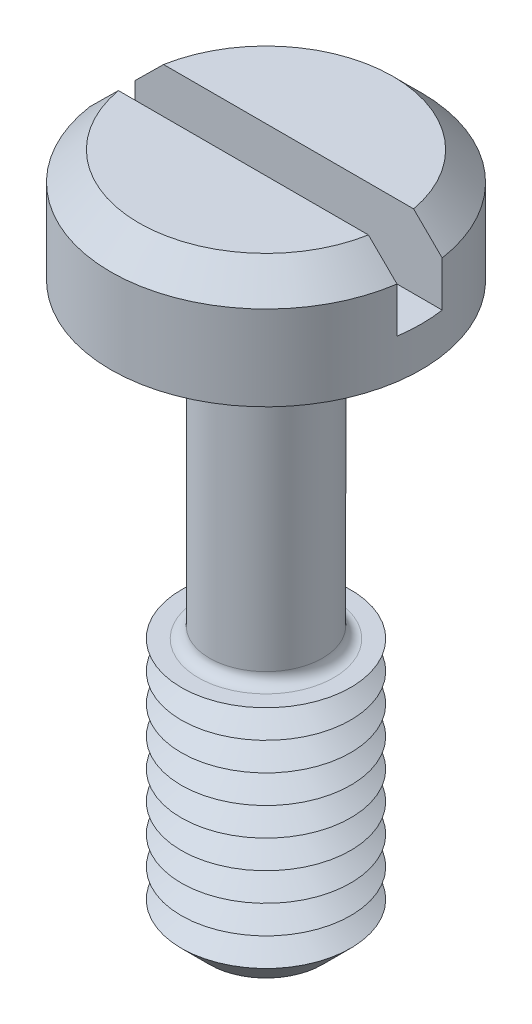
ISO-10303-21;
HEADER;
FILE_DESCRIPTION(('STEP AP214'),'2;1');
FILE_NAME('part.step','',(''),(''),'','','');
FILE_SCHEMA(('AUTOMOTIVE_DESIGN { 1 0 10303 214 1 1 1 1 }'));
ENDSEC;
DATA;
#1=APPLICATION_CONTEXT('core data for automotive mechanical design processes');
#2=APPLICATION_PROTOCOL_DEFINITION('international standard','automotive_design',2000,#1);
#3=PRODUCT_CONTEXT('',#1,'mechanical');
#4=PRODUCT('Part','Part','',(#3));
#5=PRODUCT_RELATED_PRODUCT_CATEGORY('part','',(#4));
#6=PRODUCT_DEFINITION_FORMATION('','',#4);
#7=PRODUCT_DEFINITION_CONTEXT('part definition',#1,'design');
#8=PRODUCT_DEFINITION('design','',#6,#7);
#9=PRODUCT_DEFINITION_SHAPE('','',#8);
#10=(LENGTH_UNIT() NAMED_UNIT(*) SI_UNIT(.MILLI.,.METRE.));
#11=(NAMED_UNIT(*) PLANE_ANGLE_UNIT() SI_UNIT($,.RADIAN.));
#12=(NAMED_UNIT(*) SI_UNIT($,.STERADIAN.) SOLID_ANGLE_UNIT());
#13=UNCERTAINTY_MEASURE_WITH_UNIT(LENGTH_MEASURE(1.E-05),#10,'distance_accuracy_value','');
#14=(GEOMETRIC_REPRESENTATION_CONTEXT(3) GLOBAL_UNCERTAINTY_ASSIGNED_CONTEXT((#13)) GLOBAL_UNIT_ASSIGNED_CONTEXT((#10,
#11,#12)) REPRESENTATION_CONTEXT('',''));
#15=CARTESIAN_POINT('',(0.,0.,0.));
#16=DIRECTION('',(0.,0.,1.));
#17=DIRECTION('',(1.,0.,0.));
#18=AXIS2_PLACEMENT_3D('',#15,#16,#17);
#19=CARTESIAN_POINT('',(0.,2.,0.));
#20=DIRECTION('',(0.,1.,0.));
#21=DIRECTION('',(0.,0.,1.));
#22=AXIS2_PLACEMENT_3D('',#19,#20,#21);
#23=PLANE('',#22);
#24=DIRECTION('',(-1.,0.,0.));
#25=VECTOR('',#24,1.);
#26=CARTESIAN_POINT('',(2.75,2.,-0.4));
#27=LINE('',#26,#25);
#28=CARTESIAN_POINT('',(2.21415898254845,2.,-0.4));
#29=VERTEX_POINT('',#28);
#30=CARTESIAN_POINT('',(-2.21415898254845,2.,-0.4));
#31=VERTEX_POINT('',#30);
#32=EDGE_CURVE('E110',#29,#31,#27,.T.);
#33=ORIENTED_EDGE('',*,*,#32,.F.);
#34=CARTESIAN_POINT('',(0.,2.,0.));
#35=DIRECTION('',(0.,1.,0.));
#36=DIRECTION('',(0.,0.,1.));
#37=AXIS2_PLACEMENT_3D('',#34,#35,#36);
#38=CIRCLE('',#37,2.25);
#39=EDGE_CURVE('E113',#29,#31,#38,.T.);
#40=ORIENTED_EDGE('',*,*,#39,.T.);
#41=EDGE_LOOP('',(#33,#40));
#42=FACE_BOUND('',#41,.T.);
#43=ADVANCED_FACE('F39',(#42),#23,.T.);
#44=CARTESIAN_POINT('',(0.,2.,0.));
#45=DIRECTION('',(0.,-1.,0.));
#46=DIRECTION('',(0.,0.,-1.));
#47=AXIS2_PLACEMENT_3D('',#44,#45,#46);
#48=CONICAL_SURFACE('',#47,2.25,0.785398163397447);
#49=CARTESIAN_POINT('',(6.05060089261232,-1.81380830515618,-0.4));
#50=CARTESIAN_POINT('',(5.84217393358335,-1.60583904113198,-0.4));
#51=CARTESIAN_POINT('',(5.63372707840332,-1.3978896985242,-0.4));
#52=CARTESIAN_POINT('',(5.21676338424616,-0.982052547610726,-0.4));
#53=CARTESIAN_POINT('',(5.0082465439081,-0.774164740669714,-0.4));
#54=CARTESIAN_POINT('',(4.59102343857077,-0.35838342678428,-0.4));
#55=CARTESIAN_POINT('',(4.38231713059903,-0.150489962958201,-0.4));
#56=CARTESIAN_POINT('',(3.96477014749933,0.265153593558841,-0.4));
#57=CARTESIAN_POINT('',(3.75592947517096,0.472903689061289,-0.4));
#58=CARTESIAN_POINT('',(3.33589913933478,0.890287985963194,-0.4));
#59=CARTESIAN_POINT('',(3.12470717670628,1.09991987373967,-0.4));
#60=CARTESIAN_POINT('',(2.7019134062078,1.51879562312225,-0.4));
#61=CARTESIAN_POINT('',(2.49031157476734,1.72803946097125,-0.4));
#62=CARTESIAN_POINT('',(2.17231429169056,2.04123939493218,-0.4));
#63=CARTESIAN_POINT('',(2.06623184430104,2.14551302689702,-0.4));
#64=CARTESIAN_POINT('',(1.85373145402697,2.35372301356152,-0.4));
#65=CARTESIAN_POINT('',(1.74731350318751,2.45765936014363,-0.4));
#66=CARTESIAN_POINT('',(1.53394692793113,2.6649644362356,-0.4));
#67=CARTESIAN_POINT('',(1.42699836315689,2.76833322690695,-0.4));
#68=CARTESIAN_POINT('',(1.26580938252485,2.92258234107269,-0.4));
#69=CARTESIAN_POINT('',(1.21195308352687,2.97386371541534,-0.4));
#70=CARTESIAN_POINT('',(1.10386632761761,3.07603025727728,-0.4));
#71=CARTESIAN_POINT('',(1.0496358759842,3.12691543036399,-0.4));
#72=CARTESIAN_POINT('',(0.965529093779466,3.20495157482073,-0.4));
#73=CARTESIAN_POINT('',(0.935852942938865,3.23231811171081,-0.4));
#74=CARTESIAN_POINT('',(0.876282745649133,3.28681446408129,-0.4));
#75=CARTESIAN_POINT('',(0.846388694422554,3.31394427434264,-0.4));
#76=CARTESIAN_POINT('',(0.786319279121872,3.3678876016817,-0.4));
#77=CARTESIAN_POINT('',(0.75614393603,3.39470114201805,-0.4));
#78=CARTESIAN_POINT('',(0.695411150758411,3.44788757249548,-0.4));
#79=CARTESIAN_POINT('',(0.664853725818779,3.4742604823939,-0.4));
#80=CARTESIAN_POINT('',(0.587773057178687,3.53947080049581,-0.4));
#81=CARTESIAN_POINT('',(0.540923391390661,3.57793090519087,-0.4));
#82=CARTESIAN_POINT('',(0.4691083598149,3.63368803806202,-0.4));
#83=CARTESIAN_POINT('',(0.444902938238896,3.65195872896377,-0.4));
#84=CARTESIAN_POINT('',(0.39579650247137,3.68753467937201,-0.4));
#85=CARTESIAN_POINT('',(0.370895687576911,3.70484021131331,-0.4));
#86=CARTESIAN_POINT('',(0.315135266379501,3.74129905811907,-0.4));
#87=CARTESIAN_POINT('',(0.284069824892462,3.76014262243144,-0.4));
#88=CARTESIAN_POINT('',(0.220007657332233,3.79429188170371,-0.4));
#89=CARTESIAN_POINT('',(0.187014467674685,3.80960381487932,-0.4));
#90=CARTESIAN_POINT('',(0.129469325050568,3.83013103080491,-0.4));
#91=CARTESIAN_POINT('',(0.105533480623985,3.83700748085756,-0.4));
#92=CARTESIAN_POINT('',(0.0568861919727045,3.8466714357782,-0.4));
#93=CARTESIAN_POINT('',(0.0321777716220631,3.84947323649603,-0.4));
#94=CARTESIAN_POINT('',(-0.0174556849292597,3.8503913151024,-0.4));
#95=CARTESIAN_POINT('',(-0.0423811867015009,3.84848412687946,-0.4));
#96=CARTESIAN_POINT('',(-0.0915464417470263,3.84038297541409,-0.4));
#97=CARTESIAN_POINT('',(-0.115784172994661,3.83417751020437,-0.4));
#98=CARTESIAN_POINT('',(-0.164015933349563,3.81830420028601,-0.4));
#99=CARTESIAN_POINT('',(-0.187969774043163,3.80851974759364,-0.4));
#100=CARTESIAN_POINT('',(-0.234812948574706,3.78663483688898,-0.4));
#101=CARTESIAN_POINT('',(-0.25770025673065,3.77453017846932,-0.4));
#102=CARTESIAN_POINT('',(-0.302761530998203,3.74868049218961,-0.4));
#103=CARTESIAN_POINT('',(-0.324928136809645,3.73492286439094,-0.4));
#104=CARTESIAN_POINT('',(-0.368536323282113,3.70635481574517,-0.4));
#105=CARTESIAN_POINT('',(-0.389978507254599,3.69154530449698,-0.4));
#106=CARTESIAN_POINT('',(-0.457169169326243,3.64340388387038,-0.4));
#107=CARTESIAN_POINT('',(-0.501937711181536,3.60871473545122,-0.4));
#108=CARTESIAN_POINT('',(-0.590074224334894,3.53759028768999,-0.4));
#109=CARTESIAN_POINT('',(-0.633441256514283,3.50115385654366,-0.4));
#110=CARTESIAN_POINT('',(-0.719371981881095,3.42718980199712,-0.4));
#111=CARTESIAN_POINT('',(-0.761934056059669,3.38966030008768,-0.4));
#112=CARTESIAN_POINT('',(-0.846465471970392,3.31396862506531,-0.4));
#113=CARTESIAN_POINT('',(-0.888434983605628,3.27580664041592,-0.4));
#114=CARTESIAN_POINT('',(-1.01351008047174,3.16091722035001,-0.4));
#115=CARTESIAN_POINT('',(-1.09603733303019,3.08356131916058,-0.4));
#116=CARTESIAN_POINT('',(-1.26020205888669,2.92809304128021,-0.4));
#117=CARTESIAN_POINT('',(-1.34184039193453,2.84998156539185,-0.4));
#118=CARTESIAN_POINT('',(-1.50425180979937,2.69362860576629,-0.4));
#119=CARTESIAN_POINT('',(-1.58502715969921,2.61538947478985,-0.4));
#120=CARTESIAN_POINT('',(-1.74627332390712,2.4585978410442,-0.4));
#121=CARTESIAN_POINT('',(-1.82674413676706,2.38004533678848,-0.4));
#122=CARTESIAN_POINT('',(-2.06785619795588,2.14407469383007,-0.4));
#123=CARTESIAN_POINT('',(-2.22819388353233,1.98634651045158,-0.4));
#124=CARTESIAN_POINT('',(-2.54852691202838,1.67040441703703,-0.4));
#125=CARTESIAN_POINT('',(-2.70852207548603,1.51219032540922,-0.4));
#126=CARTESIAN_POINT('',(-3.02826273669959,1.19551306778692,-0.4));
#127=CARTESIAN_POINT('',(-3.18800823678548,1.03704990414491,-0.4));
#128=CARTESIAN_POINT('',(-3.66699080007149,0.561455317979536,-0.4));
#129=CARTESIAN_POINT('',(-3.98599924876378,0.244093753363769,-0.4));
#130=CARTESIAN_POINT('',(-4.6236988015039,-0.390879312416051,-0.4));
#131=CARTESIAN_POINT('',(-4.94238993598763,-0.708490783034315,-0.4));
#132=CARTESIAN_POINT('',(-5.39262624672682,-1.15743192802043,-0.4));
#133=CARTESIAN_POINT('',(-5.52423897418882,-1.28869385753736,-0.4));
#134=CARTESIAN_POINT('',(-5.78743776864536,-1.55123695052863,-0.4));
#135=CARTESIAN_POINT('',(-5.91902383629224,-1.68251811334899,-0.4));
#136=CARTESIAN_POINT('',(-6.05060089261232,-1.81380830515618,-0.4));
#137=B_SPLINE_CURVE_WITH_KNOTS('',3,(#49,#50,#51,#52,#53,#54,#55,#56,#57,#58,#59,#60,#61,#62,
#63,#64,#65,#66,#67,#68,#69,#70,#71,#72,#73,#74,#75,#76,#77,#78,#79,#80,#81,#82,#83,#84,#85,#86,
#87,#88,#89,#90,#91,#92,#93,#94,#95,#96,#97,#98,#99,#100,#101,#102,#103,#104,#105,#106,#107,
#108,#109,#110,#111,#112,#113,#114,#115,#116,#117,#118,#119,#120,#121,#122,#123,#124,#125,#126,
#127,#128,#129,#130,#131,#132,#133,#134,#135,#136),.UNSPECIFIED.,.F.,.F.,(4,2,2,2,2,2,2,2,2,2,2,
2,2,2,2,2,2,2,2,2,2,2,2,2,2,2,2,2,2,2,2,2,2,2,2,2,2,2,2,2,2,2,2,4),(0.,0.883310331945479,
1.76663897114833,2.65038219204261,3.53410755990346,4.42681573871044,5.31957687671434,
5.76582544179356,6.21208466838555,6.65829482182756,6.88139126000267,7.10448455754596,
7.22558850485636,7.34669511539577,7.46779276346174,7.58888496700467,7.77066509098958,
7.86163037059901,7.95256984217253,8.06146372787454,8.17016376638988,8.24461141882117,
8.31879723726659,8.39335348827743,8.46811002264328,8.54555790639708,8.62314734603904,
8.70137101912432,8.77952785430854,8.94932745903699,9.11923857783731,9.28946128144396,
9.45963414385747,9.79895964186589,10.1379210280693,10.475282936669,10.8126464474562,
11.4873867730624,12.1624208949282,12.8374486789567,14.1873973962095,15.5372009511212,
16.0948428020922,16.6524687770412),.UNSPECIFIED.);
#138=CARTESIAN_POINT('',(2.72075357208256,1.5,-0.4));
#139=VERTEX_POINT('',#138);
#140=EDGE_CURVE('E259',#139,#29,#137,.T.);
#141=ORIENTED_EDGE('',*,*,#140,.F.);
#142=CARTESIAN_POINT('',(0.,1.5,0.));
#143=DIRECTION('',(0.,1.,0.));
#144=DIRECTION('',(0.,0.,1.));
#145=AXIS2_PLACEMENT_3D('',#142,#143,#144);
#146=CIRCLE('',#145,2.75);
#147=CARTESIAN_POINT('',(-2.72075357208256,1.5,-0.4));
#148=VERTEX_POINT('',#147);
#149=EDGE_CURVE('E127',#148,#139,#146,.F.);
#150=ORIENTED_EDGE('',*,*,#149,.F.);
#151=EDGE_CURVE('E102',#31,#148,#137,.T.);
#152=ORIENTED_EDGE('',*,*,#151,.F.);
#153=ORIENTED_EDGE('',*,*,#39,.F.);
#154=EDGE_LOOP('',(#141,#150,#152,#153));
#155=FACE_BOUND('',#154,.T.);
#156=ADVANCED_FACE('F221',(#155),#48,.T.);
#157=CARTESIAN_POINT('',(0.,-10.,0.));
#158=DIRECTION('',(0.,1.,0.));
#159=DIRECTION('',(0.,0.,1.));
#160=AXIS2_PLACEMENT_3D('',#157,#158,#159);
#161=CYLINDRICAL_SURFACE('',#160,1.);
#162=CARTESIAN_POINT('',(0.,-5.3,0.));
#163=DIRECTION('',(0.,-1.,0.));
#164=DIRECTION('',(0.,0.,-1.));
#165=AXIS2_PLACEMENT_3D('',#162,#163,#164);
#166=CIRCLE('',#165,1.);
#167=CARTESIAN_POINT('',(0.,-5.3,-1.));
#168=VERTEX_POINT('',#167);
#169=EDGE_CURVE('E122',#168,#168,#166,.F.);
#170=ORIENTED_EDGE('',*,*,#169,.T.);
#171=EDGE_LOOP('',(#170));
#172=FACE_BOUND('',#171,.T.);
#173=CARTESIAN_POINT('',(0.,-0.200000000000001,0.));
#174=DIRECTION('',(0.,1.,0.));
#175=DIRECTION('',(0.,0.,1.));
#176=AXIS2_PLACEMENT_3D('',#173,#174,#175);
#177=CIRCLE('',#176,1.);
#178=CARTESIAN_POINT('',(0.,-0.200000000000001,1.));
#179=VERTEX_POINT('',#178);
#180=EDGE_CURVE('E365',#179,#179,#177,.F.);
#181=ORIENTED_EDGE('',*,*,#180,.T.);
#182=EDGE_LOOP('',(#181));
#183=FACE_BOUND('',#182,.T.);
#184=ADVANCED_FACE('F217',(#172,#183),#161,.T.);
#185=CARTESIAN_POINT('',(0.,2.,0.));
#186=DIRECTION('',(0.,-1.,0.));
#187=DIRECTION('',(0.,0.,-1.));
#188=AXIS2_PLACEMENT_3D('',#185,#186,#187);
#189=CYLINDRICAL_SURFACE('',#188,2.75);
#190=ORIENTED_EDGE('',*,*,#149,.T.);
#191=DIRECTION('',(0.,-1.,0.));
#192=VECTOR('',#191,1.);
#193=CARTESIAN_POINT('',(2.72075357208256,2.,-0.4));
#194=LINE('',#193,#192);
#195=CARTESIAN_POINT('',(2.72075357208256,0.7,-0.4));
#196=VERTEX_POINT('',#195);
#197=EDGE_CURVE('E64',#139,#196,#194,.T.);
#198=ORIENTED_EDGE('',*,*,#197,.T.);
#199=CARTESIAN_POINT('',(0.,0.7,0.));
#200=DIRECTION('',(0.,1.,0.));
#201=DIRECTION('',(0.,0.,1.));
#202=AXIS2_PLACEMENT_3D('',#199,#200,#201);
#203=CIRCLE('',#202,2.75);
#204=CARTESIAN_POINT('',(2.72075357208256,0.7,0.4));
#205=VERTEX_POINT('',#204);
#206=EDGE_CURVE('E11',#205,#196,#203,.T.);
#207=ORIENTED_EDGE('',*,*,#206,.F.);
#208=DIRECTION('',(0.,-1.,0.));
#209=VECTOR('',#208,1.);
#210=CARTESIAN_POINT('',(2.72075357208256,2.,0.4));
#211=LINE('',#210,#209);
#212=CARTESIAN_POINT('',(2.72075357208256,1.5,0.4));
#213=VERTEX_POINT('',#212);
#214=EDGE_CURVE('E275',#205,#213,#211,.F.);
#215=ORIENTED_EDGE('',*,*,#214,.T.);
#216=CARTESIAN_POINT('',(-2.72075357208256,1.5,0.4));
#217=VERTEX_POINT('',#216);
#218=EDGE_CURVE('E120',#213,#217,#146,.F.);
#219=ORIENTED_EDGE('',*,*,#218,.T.);
#220=DIRECTION('',(0.,-1.,0.));
#221=VECTOR('',#220,1.);
#222=CARTESIAN_POINT('',(-2.72075357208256,2.,0.4));
#223=LINE('',#222,#221);
#224=CARTESIAN_POINT('',(-2.72075357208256,0.7,0.4));
#225=VERTEX_POINT('',#224);
#226=EDGE_CURVE('E96',#217,#225,#223,.T.);
#227=ORIENTED_EDGE('',*,*,#226,.T.);
#228=CARTESIAN_POINT('',(-2.72075357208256,0.7,-0.4));
#229=VERTEX_POINT('',#228);
#230=EDGE_CURVE('E44',#229,#225,#203,.T.);
#231=ORIENTED_EDGE('',*,*,#230,.F.);
#232=DIRECTION('',(0.,-1.,0.));
#233=VECTOR('',#232,1.);
#234=CARTESIAN_POINT('',(-2.72075357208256,2.,-0.4));
#235=LINE('',#234,#233);
#236=EDGE_CURVE('E280',#229,#148,#235,.F.);
#237=ORIENTED_EDGE('',*,*,#236,.T.);
#238=EDGE_LOOP('',(#190,#198,#207,#215,#219,#227,#231,#237));
#239=FACE_BOUND('',#238,.T.);
#240=CARTESIAN_POINT('',(0.,0.,0.));
#241=DIRECTION('',(0.,1.,0.));
#242=DIRECTION('',(0.,0.,1.));
#243=AXIS2_PLACEMENT_3D('',#240,#241,#242);
#244=CIRCLE('',#243,2.75);
#245=CARTESIAN_POINT('',(0.,0.,2.75));
#246=VERTEX_POINT('',#245);
#247=EDGE_CURVE('E354',#246,#246,#244,.T.);
#248=ORIENTED_EDGE('',*,*,#247,.T.);
#249=EDGE_LOOP('',(#248));
#250=FACE_BOUND('',#249,.T.);
#251=ADVANCED_FACE('F220',(#239,#250),#189,.T.);
#252=DIRECTION('',(1.,0.,0.));
#253=VECTOR('',#252,1.);
#254=CARTESIAN_POINT('',(2.75,2.,0.4));
#255=LINE('',#254,#253);
#256=CARTESIAN_POINT('',(-2.21415898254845,2.,0.4));
#257=VERTEX_POINT('',#256);
#258=CARTESIAN_POINT('',(2.21415898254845,2.,0.4));
#259=VERTEX_POINT('',#258);
#260=EDGE_CURVE('E56',#257,#259,#255,.T.);
#261=ORIENTED_EDGE('',*,*,#260,.F.);
#262=EDGE_CURVE('E108',#257,#259,#38,.T.);
#263=ORIENTED_EDGE('',*,*,#262,.T.);
#264=EDGE_LOOP('',(#261,#263));
#265=FACE_BOUND('',#264,.T.);
#266=ADVANCED_FACE('F107',(#265),#23,.T.);
#267=CARTESIAN_POINT('',(0.,0.,0.));
#268=DIRECTION('',(0.,1.,0.));
#269=DIRECTION('',(0.,0.,1.));
#270=AXIS2_PLACEMENT_3D('',#267,#268,#269);
#271=PLANE('',#270);
#272=CARTESIAN_POINT('',(0.,0.,0.));
#273=DIRECTION('',(0.,1.,0.));
#274=DIRECTION('',(0.,0.,1.));
#275=AXIS2_PLACEMENT_3D('',#272,#273,#274);
#276=CIRCLE('',#275,1.2);
#277=CARTESIAN_POINT('',(0.,0.,1.2));
#278=VERTEX_POINT('',#277);
#279=EDGE_CURVE('E114',#278,#278,#276,.T.);
#280=ORIENTED_EDGE('',*,*,#279,.T.);
#281=EDGE_LOOP('',(#280));
#282=FACE_BOUND('',#281,.T.);
#283=ORIENTED_EDGE('',*,*,#247,.F.);
#284=EDGE_LOOP('',(#283));
#285=FACE_BOUND('',#284,.T.);
#286=ADVANCED_FACE('F211',(#282,#285),#271,.F.);
#287=CARTESIAN_POINT('',(0.,-5.5,0.));
#288=DIRECTION('',(0.,-1.,0.));
#289=DIRECTION('',(0.,0.,-1.));
#290=AXIS2_PLACEMENT_3D('',#287,#288,#289);
#291=PLANE('',#290);
#292=CARTESIAN_POINT('',(0.,-5.5,0.));
#293=DIRECTION('',(0.,-1.,0.));
#294=DIRECTION('',(0.,0.,-1.));
#295=AXIS2_PLACEMENT_3D('',#292,#293,#294);
#296=CIRCLE('',#295,1.2);
#297=CARTESIAN_POINT('',(0.,-5.5,-1.2));
#298=VERTEX_POINT('',#297);
#299=EDGE_CURVE('E361',#298,#298,#296,.T.);
#300=ORIENTED_EDGE('',*,*,#299,.T.);
#301=EDGE_LOOP('',(#300));
#302=FACE_BOUND('',#301,.T.);
#303=CARTESIAN_POINT('',(0.,-5.5,0.));
#304=DIRECTION('',(0.,1.,0.));
#305=DIRECTION('',(0.,0.,1.));
#306=AXIS2_PLACEMENT_3D('',#303,#304,#305);
#307=CIRCLE('',#306,1.5);
#308=CARTESIAN_POINT('',(0.,-5.5,1.5));
#309=VERTEX_POINT('',#308);
#310=EDGE_CURVE('E350',#309,#309,#307,.T.);
#311=ORIENTED_EDGE('',*,*,#310,.T.);
#312=EDGE_LOOP('',(#311));
#313=FACE_BOUND('',#312,.T.);
#314=ADVANCED_FACE('F207',(#302,#313),#291,.F.);
#315=CARTESIAN_POINT('',(0.,-5.75,0.));
#316=DIRECTION('',(0.,1.,0.));
#317=DIRECTION('',(0.,0.,1.));
#318=AXIS2_PLACEMENT_3D('',#315,#316,#317);
#319=CONICAL_SURFACE('',#318,1.06698729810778,1.0471975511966);
#320=ORIENTED_EDGE('',*,*,#310,.F.);
#321=EDGE_LOOP('',(#320));
#322=FACE_BOUND('',#321,.T.);
#323=CARTESIAN_POINT('',(0.,-5.75,0.));
#324=DIRECTION('',(0.,1.,0.));
#325=DIRECTION('',(0.,0.,1.));
#326=AXIS2_PLACEMENT_3D('',#323,#324,#325);
#327=CIRCLE('',#326,1.06698729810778);
#328=CARTESIAN_POINT('',(0.,-5.75,1.06698729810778));
#329=VERTEX_POINT('',#328);
#330=EDGE_CURVE('E346',#329,#329,#327,.T.);
#331=ORIENTED_EDGE('',*,*,#330,.T.);
#332=EDGE_LOOP('',(#331));
#333=FACE_BOUND('',#332,.T.);
#334=ADVANCED_FACE('F203',(#322,#333),#319,.T.);
#335=CARTESIAN_POINT('',(0.,-6.,0.));
#336=DIRECTION('',(0.,-1.,0.));
#337=DIRECTION('',(0.,0.,-1.));
#338=AXIS2_PLACEMENT_3D('',#335,#336,#337);
#339=CONICAL_SURFACE('',#338,1.5,1.0471975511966);
#340=ORIENTED_EDGE('',*,*,#330,.F.);
#341=EDGE_LOOP('',(#340));
#342=FACE_BOUND('',#341,.T.);
#343=CARTESIAN_POINT('',(0.,-6.,0.));
#344=DIRECTION('',(0.,1.,0.));
#345=DIRECTION('',(0.,0.,1.));
#346=AXIS2_PLACEMENT_3D('',#343,#344,#345);
#347=CIRCLE('',#346,1.5);
#348=CARTESIAN_POINT('',(0.,-6.,1.5));
#349=VERTEX_POINT('',#348);
#350=EDGE_CURVE('E342',#349,#349,#347,.T.);
#351=ORIENTED_EDGE('',*,*,#350,.T.);
#352=EDGE_LOOP('',(#351));
#353=FACE_BOUND('',#352,.T.);
#354=ADVANCED_FACE('F199',(#342,#353),#339,.T.);
#355=CARTESIAN_POINT('',(0.,-6.25,0.));
#356=DIRECTION('',(0.,1.,0.));
#357=DIRECTION('',(0.,0.,1.));
#358=AXIS2_PLACEMENT_3D('',#355,#356,#357);
#359=CONICAL_SURFACE('',#358,1.06698729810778,1.0471975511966);
#360=ORIENTED_EDGE('',*,*,#350,.F.);
#361=EDGE_LOOP('',(#360));
#362=FACE_BOUND('',#361,.T.);
#363=CARTESIAN_POINT('',(0.,-6.25,0.));
#364=DIRECTION('',(0.,1.,0.));
#365=DIRECTION('',(0.,0.,1.));
#366=AXIS2_PLACEMENT_3D('',#363,#364,#365);
#367=CIRCLE('',#366,1.06698729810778);
#368=CARTESIAN_POINT('',(0.,-6.25,1.06698729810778));
#369=VERTEX_POINT('',#368);
#370=EDGE_CURVE('E338',#369,#369,#367,.T.);
#371=ORIENTED_EDGE('',*,*,#370,.T.);
#372=EDGE_LOOP('',(#371));
#373=FACE_BOUND('',#372,.T.);
#374=ADVANCED_FACE('F195',(#362,#373),#359,.T.);
#375=CARTESIAN_POINT('',(0.,-6.5,0.));
#376=DIRECTION('',(0.,-1.,0.));
#377=DIRECTION('',(0.,0.,-1.));
#378=AXIS2_PLACEMENT_3D('',#375,#376,#377);
#379=CONICAL_SURFACE('',#378,1.5,1.0471975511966);
#380=ORIENTED_EDGE('',*,*,#370,.F.);
#381=EDGE_LOOP('',(#380));
#382=FACE_BOUND('',#381,.T.);
#383=CARTESIAN_POINT('',(0.,-6.5,0.));
#384=DIRECTION('',(0.,1.,0.));
#385=DIRECTION('',(0.,0.,1.));
#386=AXIS2_PLACEMENT_3D('',#383,#384,#385);
#387=CIRCLE('',#386,1.5);
#388=CARTESIAN_POINT('',(0.,-6.5,1.5));
#389=VERTEX_POINT('',#388);
#390=EDGE_CURVE('E335',#389,#389,#387,.T.);
#391=ORIENTED_EDGE('',*,*,#390,.T.);
#392=EDGE_LOOP('',(#391));
#393=FACE_BOUND('',#392,.T.);
#394=ADVANCED_FACE('F191',(#382,#393),#379,.T.);
#395=CARTESIAN_POINT('',(0.,-6.75,0.));
#396=DIRECTION('',(0.,1.,0.));
#397=DIRECTION('',(0.,0.,1.));
#398=AXIS2_PLACEMENT_3D('',#395,#396,#397);
#399=CONICAL_SURFACE('',#398,1.06698729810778,1.0471975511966);
#400=ORIENTED_EDGE('',*,*,#390,.F.);
#401=EDGE_LOOP('',(#400));
#402=FACE_BOUND('',#401,.T.);
#403=CARTESIAN_POINT('',(0.,-6.75,0.));
#404=DIRECTION('',(0.,1.,0.));
#405=DIRECTION('',(0.,0.,1.));
#406=AXIS2_PLACEMENT_3D('',#403,#404,#405);
#407=CIRCLE('',#406,1.06698729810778);
#408=CARTESIAN_POINT('',(0.,-6.75,1.06698729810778));
#409=VERTEX_POINT('',#408);
#410=EDGE_CURVE('E331',#409,#409,#407,.T.);
#411=ORIENTED_EDGE('',*,*,#410,.T.);
#412=EDGE_LOOP('',(#411));
#413=FACE_BOUND('',#412,.T.);
#414=ADVANCED_FACE('F187',(#402,#413),#399,.T.);
#415=CARTESIAN_POINT('',(0.,-7.,0.));
#416=DIRECTION('',(0.,-1.,0.));
#417=DIRECTION('',(0.,0.,-1.));
#418=AXIS2_PLACEMENT_3D('',#415,#416,#417);
#419=CONICAL_SURFACE('',#418,1.5,1.0471975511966);
#420=ORIENTED_EDGE('',*,*,#410,.F.);
#421=EDGE_LOOP('',(#420));
#422=FACE_BOUND('',#421,.T.);
#423=CARTESIAN_POINT('',(0.,-7.,0.));
#424=DIRECTION('',(0.,1.,0.));
#425=DIRECTION('',(0.,0.,1.));
#426=AXIS2_PLACEMENT_3D('',#423,#424,#425);
#427=CIRCLE('',#426,1.5);
#428=CARTESIAN_POINT('',(0.,-7.,1.5));
#429=VERTEX_POINT('',#428);
#430=EDGE_CURVE('E327',#429,#429,#427,.T.);
#431=ORIENTED_EDGE('',*,*,#430,.T.);
#432=EDGE_LOOP('',(#431));
#433=FACE_BOUND('',#432,.T.);
#434=ADVANCED_FACE('F183',(#422,#433),#419,.T.);
#435=CARTESIAN_POINT('',(0.,-7.25,0.));
#436=DIRECTION('',(0.,1.,0.));
#437=DIRECTION('',(0.,0.,1.));
#438=AXIS2_PLACEMENT_3D('',#435,#436,#437);
#439=CONICAL_SURFACE('',#438,1.06698729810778,1.0471975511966);
#440=ORIENTED_EDGE('',*,*,#430,.F.);
#441=EDGE_LOOP('',(#440));
#442=FACE_BOUND('',#441,.T.);
#443=CARTESIAN_POINT('',(0.,-7.25,0.));
#444=DIRECTION('',(0.,1.,0.));
#445=DIRECTION('',(0.,0.,1.));
#446=AXIS2_PLACEMENT_3D('',#443,#444,#445);
#447=CIRCLE('',#446,1.06698729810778);
#448=CARTESIAN_POINT('',(0.,-7.25,1.06698729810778));
#449=VERTEX_POINT('',#448);
#450=EDGE_CURVE('E323',#449,#449,#447,.T.);
#451=ORIENTED_EDGE('',*,*,#450,.T.);
#452=EDGE_LOOP('',(#451));
#453=FACE_BOUND('',#452,.T.);
#454=ADVANCED_FACE('F179',(#442,#453),#439,.T.);
#455=CARTESIAN_POINT('',(0.,-7.5,0.));
#456=DIRECTION('',(0.,-1.,0.));
#457=DIRECTION('',(0.,0.,-1.));
#458=AXIS2_PLACEMENT_3D('',#455,#456,#457);
#459=CONICAL_SURFACE('',#458,1.5,1.0471975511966);
#460=ORIENTED_EDGE('',*,*,#450,.F.);
#461=EDGE_LOOP('',(#460));
#462=FACE_BOUND('',#461,.T.);
#463=CARTESIAN_POINT('',(0.,-7.5,0.));
#464=DIRECTION('',(0.,1.,0.));
#465=DIRECTION('',(0.,0.,1.));
#466=AXIS2_PLACEMENT_3D('',#463,#464,#465);
#467=CIRCLE('',#466,1.5);
#468=CARTESIAN_POINT('',(0.,-7.5,1.5));
#469=VERTEX_POINT('',#468);
#470=EDGE_CURVE('E319',#469,#469,#467,.T.);
#471=ORIENTED_EDGE('',*,*,#470,.T.);
#472=EDGE_LOOP('',(#471));
#473=FACE_BOUND('',#472,.T.);
#474=ADVANCED_FACE('F175',(#462,#473),#459,.T.);
#475=CARTESIAN_POINT('',(0.,-7.75,0.));
#476=DIRECTION('',(0.,1.,0.));
#477=DIRECTION('',(0.,0.,1.));
#478=AXIS2_PLACEMENT_3D('',#475,#476,#477);
#479=CONICAL_SURFACE('',#478,1.06698729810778,1.0471975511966);
#480=ORIENTED_EDGE('',*,*,#470,.F.);
#481=EDGE_LOOP('',(#480));
#482=FACE_BOUND('',#481,.T.);
#483=CARTESIAN_POINT('',(0.,-7.75,0.));
#484=DIRECTION('',(0.,1.,0.));
#485=DIRECTION('',(0.,0.,1.));
#486=AXIS2_PLACEMENT_3D('',#483,#484,#485);
#487=CIRCLE('',#486,1.06698729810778);
#488=CARTESIAN_POINT('',(0.,-7.75,1.06698729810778));
#489=VERTEX_POINT('',#488);
#490=EDGE_CURVE('E315',#489,#489,#487,.T.);
#491=ORIENTED_EDGE('',*,*,#490,.T.);
#492=EDGE_LOOP('',(#491));
#493=FACE_BOUND('',#492,.T.);
#494=ADVANCED_FACE('F171',(#482,#493),#479,.T.);
#495=CARTESIAN_POINT('',(0.,-8.,0.));
#496=DIRECTION('',(0.,-1.,0.));
#497=DIRECTION('',(0.,0.,-1.));
#498=AXIS2_PLACEMENT_3D('',#495,#496,#497);
#499=CONICAL_SURFACE('',#498,1.5,1.0471975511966);
#500=ORIENTED_EDGE('',*,*,#490,.F.);
#501=EDGE_LOOP('',(#500));
#502=FACE_BOUND('',#501,.T.);
#503=CARTESIAN_POINT('',(0.,-8.,0.));
#504=DIRECTION('',(0.,1.,0.));
#505=DIRECTION('',(0.,0.,1.));
#506=AXIS2_PLACEMENT_3D('',#503,#504,#505);
#507=CIRCLE('',#506,1.5);
#508=CARTESIAN_POINT('',(0.,-8.,1.5));
#509=VERTEX_POINT('',#508);
#510=EDGE_CURVE('E312',#509,#509,#507,.T.);
#511=ORIENTED_EDGE('',*,*,#510,.T.);
#512=EDGE_LOOP('',(#511));
#513=FACE_BOUND('',#512,.T.);
#514=ADVANCED_FACE('F167',(#502,#513),#499,.T.);
#515=CARTESIAN_POINT('',(0.,-8.25,0.));
#516=DIRECTION('',(0.,1.,0.));
#517=DIRECTION('',(0.,0.,1.));
#518=AXIS2_PLACEMENT_3D('',#515,#516,#517);
#519=CONICAL_SURFACE('',#518,1.06698729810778,1.0471975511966);
#520=ORIENTED_EDGE('',*,*,#510,.F.);
#521=EDGE_LOOP('',(#520));
#522=FACE_BOUND('',#521,.T.);
#523=CARTESIAN_POINT('',(0.,-8.25,0.));
#524=DIRECTION('',(0.,1.,0.));
#525=DIRECTION('',(0.,0.,1.));
#526=AXIS2_PLACEMENT_3D('',#523,#524,#525);
#527=CIRCLE('',#526,1.06698729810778);
#528=CARTESIAN_POINT('',(0.,-8.25,1.06698729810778));
#529=VERTEX_POINT('',#528);
#530=EDGE_CURVE('E308',#529,#529,#527,.T.);
#531=ORIENTED_EDGE('',*,*,#530,.T.);
#532=EDGE_LOOP('',(#531));
#533=FACE_BOUND('',#532,.T.);
#534=ADVANCED_FACE('F163',(#522,#533),#519,.T.);
#535=CARTESIAN_POINT('',(0.,-8.5,0.));
#536=DIRECTION('',(0.,-1.,0.));
#537=DIRECTION('',(0.,0.,-1.));
#538=AXIS2_PLACEMENT_3D('',#535,#536,#537);
#539=CONICAL_SURFACE('',#538,1.5,1.0471975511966);
#540=ORIENTED_EDGE('',*,*,#530,.F.);
#541=EDGE_LOOP('',(#540));
#542=FACE_BOUND('',#541,.T.);
#543=CARTESIAN_POINT('',(0.,-8.5,0.));
#544=DIRECTION('',(0.,1.,0.));
#545=DIRECTION('',(0.,0.,1.));
#546=AXIS2_PLACEMENT_3D('',#543,#544,#545);
#547=CIRCLE('',#546,1.5);
#548=CARTESIAN_POINT('',(0.,-8.5,1.5));
#549=VERTEX_POINT('',#548);
#550=EDGE_CURVE('E304',#549,#549,#547,.T.);
#551=ORIENTED_EDGE('',*,*,#550,.T.);
#552=EDGE_LOOP('',(#551));
#553=FACE_BOUND('',#552,.T.);
#554=ADVANCED_FACE('F159',(#542,#553),#539,.T.);
#555=CARTESIAN_POINT('',(0.,-8.75,0.));
#556=DIRECTION('',(0.,1.,0.));
#557=DIRECTION('',(0.,0.,1.));
#558=AXIS2_PLACEMENT_3D('',#555,#556,#557);
#559=CONICAL_SURFACE('',#558,1.06698729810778,1.0471975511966);
#560=ORIENTED_EDGE('',*,*,#550,.F.);
#561=EDGE_LOOP('',(#560));
#562=FACE_BOUND('',#561,.T.);
#563=CARTESIAN_POINT('',(0.,-8.75,0.));
#564=DIRECTION('',(0.,1.,0.));
#565=DIRECTION('',(0.,0.,1.));
#566=AXIS2_PLACEMENT_3D('',#563,#564,#565);
#567=CIRCLE('',#566,1.06698729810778);
#568=CARTESIAN_POINT('',(0.,-8.75,1.06698729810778));
#569=VERTEX_POINT('',#568);
#570=EDGE_CURVE('E300',#569,#569,#567,.T.);
#571=ORIENTED_EDGE('',*,*,#570,.T.);
#572=EDGE_LOOP('',(#571));
#573=FACE_BOUND('',#572,.T.);
#574=ADVANCED_FACE('F155',(#562,#573),#559,.T.);
#575=CARTESIAN_POINT('',(0.,-9.,0.));
#576=DIRECTION('',(0.,-1.,0.));
#577=DIRECTION('',(0.,0.,-1.));
#578=AXIS2_PLACEMENT_3D('',#575,#576,#577);
#579=CONICAL_SURFACE('',#578,1.5,1.0471975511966);
#580=ORIENTED_EDGE('',*,*,#570,.F.);
#581=EDGE_LOOP('',(#580));
#582=FACE_BOUND('',#581,.T.);
#583=CARTESIAN_POINT('',(0.,-9.,0.));
#584=DIRECTION('',(0.,1.,0.));
#585=DIRECTION('',(0.,0.,1.));
#586=AXIS2_PLACEMENT_3D('',#583,#584,#585);
#587=CIRCLE('',#586,1.5);
#588=CARTESIAN_POINT('',(0.,-9.,1.5));
#589=VERTEX_POINT('',#588);
#590=EDGE_CURVE('E296',#589,#589,#587,.T.);
#591=ORIENTED_EDGE('',*,*,#590,.T.);
#592=EDGE_LOOP('',(#591));
#593=FACE_BOUND('',#592,.T.);
#594=ADVANCED_FACE('F151',(#582,#593),#579,.T.);
#595=CARTESIAN_POINT('',(0.,-9.25,0.));
#596=DIRECTION('',(0.,1.,0.));
#597=DIRECTION('',(0.,0.,1.));
#598=AXIS2_PLACEMENT_3D('',#595,#596,#597);
#599=CONICAL_SURFACE('',#598,1.06698729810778,1.0471975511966);
#600=ORIENTED_EDGE('',*,*,#590,.F.);
#601=EDGE_LOOP('',(#600));
#602=FACE_BOUND('',#601,.T.);
#603=CARTESIAN_POINT('',(0.,-9.25,0.));
#604=DIRECTION('',(0.,1.,0.));
#605=DIRECTION('',(0.,0.,1.));
#606=AXIS2_PLACEMENT_3D('',#603,#604,#605);
#607=CIRCLE('',#606,1.06698729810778);
#608=CARTESIAN_POINT('',(0.,-9.25,1.06698729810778));
#609=VERTEX_POINT('',#608);
#610=EDGE_CURVE('E292',#609,#609,#607,.T.);
#611=ORIENTED_EDGE('',*,*,#610,.T.);
#612=EDGE_LOOP('',(#611));
#613=FACE_BOUND('',#612,.T.);
#614=ADVANCED_FACE('F147',(#602,#613),#599,.T.);
#615=CARTESIAN_POINT('',(0.,-9.5,0.));
#616=DIRECTION('',(0.,-1.,0.));
#617=DIRECTION('',(0.,0.,-1.));
#618=AXIS2_PLACEMENT_3D('',#615,#616,#617);
#619=CONICAL_SURFACE('',#618,1.5,1.0471975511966);
#620=ORIENTED_EDGE('',*,*,#610,.F.);
#621=EDGE_LOOP('',(#620));
#622=FACE_BOUND('',#621,.T.);
#623=CARTESIAN_POINT('',(0.,-9.5,0.));
#624=DIRECTION('',(0.,1.,0.));
#625=DIRECTION('',(0.,0.,1.));
#626=AXIS2_PLACEMENT_3D('',#623,#624,#625);
#627=CIRCLE('',#626,1.5);
#628=CARTESIAN_POINT('',(0.,-9.5,1.5));
#629=VERTEX_POINT('',#628);
#630=EDGE_CURVE('E288',#629,#629,#627,.T.);
#631=ORIENTED_EDGE('',*,*,#630,.T.);
#632=EDGE_LOOP('',(#631));
#633=FACE_BOUND('',#632,.T.);
#634=ADVANCED_FACE('F143',(#622,#633),#619,.T.);
#635=CARTESIAN_POINT('',(0.,-10.,0.));
#636=DIRECTION('',(0.,-1.,0.));
#637=DIRECTION('',(0.,0.,-1.));
#638=AXIS2_PLACEMENT_3D('',#635,#636,#637);
#639=PLANE('',#638);
#640=CARTESIAN_POINT('',(0.,-10.,0.));
#641=DIRECTION('',(0.,-1.,0.));
#642=DIRECTION('',(0.,0.,-1.));
#643=AXIS2_PLACEMENT_3D('',#640,#641,#642);
#644=CIRCLE('',#643,0.999999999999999);
#645=CARTESIAN_POINT('',(0.,-10.,-0.999999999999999));
#646=VERTEX_POINT('',#645);
#647=EDGE_CURVE('E358',#646,#646,#644,.T.);
#648=ORIENTED_EDGE('',*,*,#647,.T.);
#649=EDGE_LOOP('',(#648));
#650=FACE_BOUND('',#649,.T.);
#651=ADVANCED_FACE('F146',(#650),#639,.T.);
#652=CARTESIAN_POINT('',(0.,-10.,0.));
#653=DIRECTION('',(0.,1.,0.));
#654=DIRECTION('',(0.,0.,1.));
#655=AXIS2_PLACEMENT_3D('',#652,#653,#654);
#656=CONICAL_SURFACE('',#655,0.999999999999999,0.785398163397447);
#657=ORIENTED_EDGE('',*,*,#630,.F.);
#658=EDGE_LOOP('',(#657));
#659=FACE_BOUND('',#658,.T.);
#660=ORIENTED_EDGE('',*,*,#647,.F.);
#661=EDGE_LOOP('',(#660));
#662=FACE_BOUND('',#661,.T.);
#663=ADVANCED_FACE('F215',(#659,#662),#656,.T.);
#664=CARTESIAN_POINT('',(0.,-5.3,0.));
#665=DIRECTION('',(0.,-1.,0.));
#666=DIRECTION('',(0.,0.,-1.));
#667=AXIS2_PLACEMENT_3D('',#664,#665,#666);
#668=TOROIDAL_SURFACE('',#667,1.2,0.2);
#669=ORIENTED_EDGE('',*,*,#169,.F.);
#670=EDGE_LOOP('',(#669));
#671=FACE_BOUND('',#670,.T.);
#672=ORIENTED_EDGE('',*,*,#299,.F.);
#673=EDGE_LOOP('',(#672));
#674=FACE_BOUND('',#673,.T.);
#675=ADVANCED_FACE('F233',(#671,#674),#668,.F.);
#676=CARTESIAN_POINT('',(0.,-0.200000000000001,0.));
#677=DIRECTION('',(0.,1.,0.));
#678=DIRECTION('',(0.,0.,1.));
#679=AXIS2_PLACEMENT_3D('',#676,#677,#678);
#680=TOROIDAL_SURFACE('',#679,1.2,0.2);
#681=ORIENTED_EDGE('',*,*,#279,.F.);
#682=EDGE_LOOP('',(#681));
#683=FACE_BOUND('',#682,.T.);
#684=ORIENTED_EDGE('',*,*,#180,.F.);
#685=EDGE_LOOP('',(#684));
#686=FACE_BOUND('',#685,.T.);
#687=ADVANCED_FACE('F236',(#683,#686),#680,.F.);
#688=CARTESIAN_POINT('',(-6.05060089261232,-1.81380830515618,0.4));
#689=CARTESIAN_POINT('',(-5.84217393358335,-1.60583904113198,0.4));
#690=CARTESIAN_POINT('',(-5.63372707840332,-1.3978896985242,0.4));
#691=CARTESIAN_POINT('',(-5.21676338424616,-0.982052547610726,0.4));
#692=CARTESIAN_POINT('',(-5.0082465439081,-0.774164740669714,0.4));
#693=CARTESIAN_POINT('',(-4.59102343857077,-0.35838342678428,0.4));
#694=CARTESIAN_POINT('',(-4.38231713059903,-0.150489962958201,0.4));
#695=CARTESIAN_POINT('',(-3.96477014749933,0.265153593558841,0.4));
#696=CARTESIAN_POINT('',(-3.75592947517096,0.47290368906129,0.4));
#697=CARTESIAN_POINT('',(-3.33589913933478,0.890287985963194,0.4));
#698=CARTESIAN_POINT('',(-3.12470717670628,1.09991987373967,0.4));
#699=CARTESIAN_POINT('',(-2.7019134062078,1.51879562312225,0.4));
#700=CARTESIAN_POINT('',(-2.49031157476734,1.72803946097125,0.4));
#701=CARTESIAN_POINT('',(-2.17231429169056,2.04123939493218,0.4));
#702=CARTESIAN_POINT('',(-2.06623184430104,2.14551302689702,0.4));
#703=CARTESIAN_POINT('',(-1.85373145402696,2.35372301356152,0.4));
#704=CARTESIAN_POINT('',(-1.74731350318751,2.45765936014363,0.4));
#705=CARTESIAN_POINT('',(-1.53394692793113,2.6649644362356,0.4));
#706=CARTESIAN_POINT('',(-1.42699836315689,2.76833322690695,0.4));
#707=CARTESIAN_POINT('',(-1.26580938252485,2.92258234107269,0.4));
#708=CARTESIAN_POINT('',(-1.21195308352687,2.97386371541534,0.4));
#709=CARTESIAN_POINT('',(-1.10386632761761,3.07603025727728,0.4));
#710=CARTESIAN_POINT('',(-1.0496358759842,3.12691543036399,0.4));
#711=CARTESIAN_POINT('',(-0.965529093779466,3.20495157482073,0.4));
#712=CARTESIAN_POINT('',(-0.935852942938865,3.23231811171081,0.4));
#713=CARTESIAN_POINT('',(-0.876282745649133,3.28681446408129,0.4));
#714=CARTESIAN_POINT('',(-0.846388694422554,3.31394427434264,0.4));
#715=CARTESIAN_POINT('',(-0.786319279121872,3.3678876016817,0.4));
#716=CARTESIAN_POINT('',(-0.75614393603,3.39470114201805,0.4));
#717=CARTESIAN_POINT('',(-0.695411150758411,3.44788757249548,0.4));
#718=CARTESIAN_POINT('',(-0.664853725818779,3.4742604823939,0.4));
#719=CARTESIAN_POINT('',(-0.587773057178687,3.53947080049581,0.4));
#720=CARTESIAN_POINT('',(-0.540923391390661,3.57793090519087,0.4));
#721=CARTESIAN_POINT('',(-0.4691083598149,3.63368803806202,0.4));
#722=CARTESIAN_POINT('',(-0.444902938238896,3.65195872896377,0.4));
#723=CARTESIAN_POINT('',(-0.39579650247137,3.68753467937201,0.4));
#724=CARTESIAN_POINT('',(-0.370895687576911,3.70484021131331,0.4));
#725=CARTESIAN_POINT('',(-0.315135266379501,3.74129905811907,0.4));
#726=CARTESIAN_POINT('',(-0.284069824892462,3.76014262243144,0.4));
#727=CARTESIAN_POINT('',(-0.220007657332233,3.79429188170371,0.4));
#728=CARTESIAN_POINT('',(-0.187014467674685,3.80960381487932,0.4));
#729=CARTESIAN_POINT('',(-0.129469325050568,3.83013103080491,0.4));
#730=CARTESIAN_POINT('',(-0.105533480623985,3.83700748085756,0.4));
#731=CARTESIAN_POINT('',(-0.0568861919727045,3.8466714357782,0.4));
#732=CARTESIAN_POINT('',(-0.0321777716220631,3.84947323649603,0.4));
#733=CARTESIAN_POINT('',(0.0174556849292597,3.8503913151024,0.4));
#734=CARTESIAN_POINT('',(0.0423811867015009,3.84848412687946,0.4));
#735=CARTESIAN_POINT('',(0.0915464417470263,3.84038297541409,0.4));
#736=CARTESIAN_POINT('',(0.115784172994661,3.83417751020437,0.4));
#737=CARTESIAN_POINT('',(0.164015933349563,3.81830420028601,0.4));
#738=CARTESIAN_POINT('',(0.187969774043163,3.80851974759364,0.4));
#739=CARTESIAN_POINT('',(0.234812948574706,3.78663483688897,0.4));
#740=CARTESIAN_POINT('',(0.25770025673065,3.77453017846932,0.4));
#741=CARTESIAN_POINT('',(0.302761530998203,3.74868049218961,0.4));
#742=CARTESIAN_POINT('',(0.324928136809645,3.73492286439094,0.4));
#743=CARTESIAN_POINT('',(0.368536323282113,3.70635481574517,0.4));
#744=CARTESIAN_POINT('',(0.389978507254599,3.69154530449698,0.4));
#745=CARTESIAN_POINT('',(0.457169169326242,3.64340388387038,0.4));
#746=CARTESIAN_POINT('',(0.501937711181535,3.60871473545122,0.4));
#747=CARTESIAN_POINT('',(0.590074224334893,3.53759028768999,0.4));
#748=CARTESIAN_POINT('',(0.633441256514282,3.50115385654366,0.4));
#749=CARTESIAN_POINT('',(0.719371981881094,3.42718980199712,0.4));
#750=CARTESIAN_POINT('',(0.761934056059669,3.38966030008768,0.4));
#751=CARTESIAN_POINT('',(0.846465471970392,3.31396862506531,0.4));
#752=CARTESIAN_POINT('',(0.888434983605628,3.27580664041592,0.4));
#753=CARTESIAN_POINT('',(1.01351008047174,3.16091722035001,0.4));
#754=CARTESIAN_POINT('',(1.09603733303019,3.08356131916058,0.4));
#755=CARTESIAN_POINT('',(1.26020205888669,2.92809304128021,0.4));
#756=CARTESIAN_POINT('',(1.34184039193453,2.84998156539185,0.4));
#757=CARTESIAN_POINT('',(1.50425180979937,2.69362860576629,0.4));
#758=CARTESIAN_POINT('',(1.58502715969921,2.61538947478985,0.4));
#759=CARTESIAN_POINT('',(1.74627332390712,2.4585978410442,0.4));
#760=CARTESIAN_POINT('',(1.82674413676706,2.38004533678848,0.4));
#761=CARTESIAN_POINT('',(2.06785619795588,2.14407469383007,0.4));
#762=CARTESIAN_POINT('',(2.22819388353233,1.98634651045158,0.4));
#763=CARTESIAN_POINT('',(2.54852691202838,1.67040441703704,0.4));
#764=CARTESIAN_POINT('',(2.70852207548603,1.51219032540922,0.4));
#765=CARTESIAN_POINT('',(3.02826273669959,1.19551306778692,0.4));
#766=CARTESIAN_POINT('',(3.18800823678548,1.03704990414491,0.4));
#767=CARTESIAN_POINT('',(3.66699080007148,0.561455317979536,0.4));
#768=CARTESIAN_POINT('',(3.98599924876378,0.244093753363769,0.4));
#769=CARTESIAN_POINT('',(4.6236988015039,-0.39087931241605,0.4));
#770=CARTESIAN_POINT('',(4.94238993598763,-0.708490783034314,0.4));
#771=CARTESIAN_POINT('',(5.39262624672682,-1.15743192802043,0.4));
#772=CARTESIAN_POINT('',(5.52423897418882,-1.28869385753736,0.4));
#773=CARTESIAN_POINT('',(5.78743776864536,-1.55123695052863,0.4));
#774=CARTESIAN_POINT('',(5.91902383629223,-1.68251811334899,0.4));
#775=CARTESIAN_POINT('',(6.05060089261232,-1.81380830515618,0.4));
#776=B_SPLINE_CURVE_WITH_KNOTS('',3,(#688,#689,#690,#691,#692,#693,#694,#695,#696,#697,#698,
#699,#700,#701,#702,#703,#704,#705,#706,#707,#708,#709,#710,#711,#712,#713,#714,#715,#716,#717,
#718,#719,#720,#721,#722,#723,#724,#725,#726,#727,#728,#729,#730,#731,#732,#733,#734,#735,#736,
#737,#738,#739,#740,#741,#742,#743,#744,#745,#746,#747,#748,#749,#750,#751,#752,#753,#754,#755,
#756,#757,#758,#759,#760,#761,#762,#763,#764,#765,#766,#767,#768,#769,#770,#771,#772,#773,#774,
#775),.UNSPECIFIED.,.F.,.F.,(4,2,2,2,2,2,2,2,2,2,2,2,2,2,2,2,2,2,2,2,2,2,2,2,2,2,2,2,2,2,2,2,2,
2,2,2,2,2,2,2,2,2,2,4),(0.,0.883310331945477,1.76663897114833,2.65038219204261,3.53410755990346,
4.42681573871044,5.31957687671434,5.76582544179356,6.21208466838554,6.65829482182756,
6.88139126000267,7.10448455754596,7.22558850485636,7.34669511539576,7.46779276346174,
7.58888496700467,7.77066509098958,7.86163037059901,7.95256984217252,8.06146372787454,
8.17016376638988,8.24461141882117,8.31879723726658,8.39335348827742,8.46811002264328,
8.54555790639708,8.62314734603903,8.70137101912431,8.77952785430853,8.94932745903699,
9.11923857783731,9.28946128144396,9.45963414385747,9.79895964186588,10.1379210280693,
10.475282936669,10.8126464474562,11.4873867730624,12.1624208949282,12.8374486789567,
14.1873973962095,15.5372009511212,16.0948428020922,16.6524687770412),.UNSPECIFIED.);
#777=EDGE_CURVE('E92',#217,#257,#776,.T.);
#778=ORIENTED_EDGE('',*,*,#777,.F.);
#779=ORIENTED_EDGE('',*,*,#218,.F.);
#780=EDGE_CURVE('E103',#259,#213,#776,.T.);
#781=ORIENTED_EDGE('',*,*,#780,.F.);
#782=ORIENTED_EDGE('',*,*,#262,.F.);
#783=EDGE_LOOP('',(#778,#779,#781,#782));
#784=FACE_BOUND('',#783,.T.);
#785=ADVANCED_FACE('F41',(#784),#48,.T.);
#786=CARTESIAN_POINT('',(0.,0.7,0.));
#787=DIRECTION('',(0.,1.,0.));
#788=DIRECTION('',(0.,0.,1.));
#789=AXIS2_PLACEMENT_3D('',#786,#787,#788);
#790=PLANE('',#789);
#791=DIRECTION('',(1.,0.,0.));
#792=VECTOR('',#791,1.);
#793=CARTESIAN_POINT('',(2.75,0.7,0.4));
#794=LINE('',#793,#792);
#795=EDGE_CURVE('E256',#225,#205,#794,.T.);
#796=ORIENTED_EDGE('',*,*,#795,.T.);
#797=ORIENTED_EDGE('',*,*,#206,.T.);
#798=DIRECTION('',(-1.,0.,0.));
#799=VECTOR('',#798,1.);
#800=CARTESIAN_POINT('',(2.75,0.7,-0.4));
#801=LINE('',#800,#799);
#802=EDGE_CURVE('E272',#196,#229,#801,.T.);
#803=ORIENTED_EDGE('',*,*,#802,.T.);
#804=ORIENTED_EDGE('',*,*,#230,.T.);
#805=EDGE_LOOP('',(#796,#797,#803,#804));
#806=FACE_BOUND('',#805,.T.);
#807=ADVANCED_FACE('F243',(#806),#790,.T.);
#808=CARTESIAN_POINT('',(2.75,0.7,-0.4));
#809=DIRECTION('',(0.,0.,-1.));
#810=DIRECTION('',(-1.,0.,0.));
#811=AXIS2_PLACEMENT_3D('',#808,#809,#810);
#812=PLANE('',#811);
#813=ORIENTED_EDGE('',*,*,#140,.T.);
#814=ORIENTED_EDGE('',*,*,#32,.T.);
#815=ORIENTED_EDGE('',*,*,#151,.T.);
#816=ORIENTED_EDGE('',*,*,#236,.F.);
#817=ORIENTED_EDGE('',*,*,#802,.F.);
#818=ORIENTED_EDGE('',*,*,#197,.F.);
#819=EDGE_LOOP('',(#813,#814,#815,#816,#817,#818));
#820=FACE_BOUND('',#819,.T.);
#821=ADVANCED_FACE('F140',(#820),#812,.F.);
#822=CARTESIAN_POINT('',(2.75,0.7,0.4));
#823=DIRECTION('',(0.,0.,1.));
#824=DIRECTION('',(1.,0.,0.));
#825=AXIS2_PLACEMENT_3D('',#822,#823,#824);
#826=PLANE('',#825);
#827=ORIENTED_EDGE('',*,*,#777,.T.);
#828=ORIENTED_EDGE('',*,*,#260,.T.);
#829=ORIENTED_EDGE('',*,*,#780,.T.);
#830=ORIENTED_EDGE('',*,*,#214,.F.);
#831=ORIENTED_EDGE('',*,*,#795,.F.);
#832=ORIENTED_EDGE('',*,*,#226,.F.);
#833=EDGE_LOOP('',(#827,#828,#829,#830,#831,#832));
#834=FACE_BOUND('',#833,.T.);
#835=ADVANCED_FACE('F93',(#834),#826,.F.);
#836=CLOSED_SHELL('',(#43,#156,#184,#251,#266,#286,#314,#334,#354,#374,#394,#414,#434,#454,#474,
#494,#514,#534,#554,#574,#594,#614,#634,#651,#663,#675,#687,#785,#807,#821,#835));
#837=MANIFOLD_SOLID_BREP('B2',#836);
#838=ADVANCED_BREP_SHAPE_REPRESENTATION('',(#18,#837),#14);
#839=SHAPE_DEFINITION_REPRESENTATION(#9,#838);
ENDSEC;
END-ISO-10303-21;
